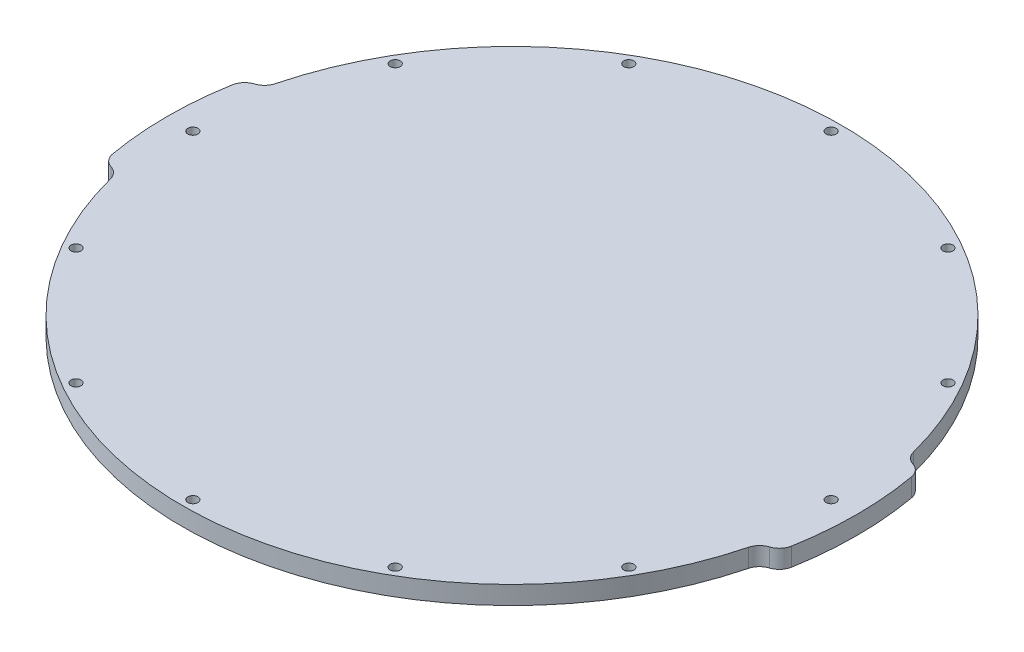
ISO-10303-21;
HEADER;
FILE_DESCRIPTION(('STEP AP214'),'2;1');
FILE_NAME('part.step','',(''),(''),'','','');
FILE_SCHEMA(('AUTOMOTIVE_DESIGN { 1 0 10303 214 1 1 1 1 }'));
ENDSEC;
DATA;
#1=APPLICATION_CONTEXT('core data for automotive mechanical design processes');
#2=APPLICATION_PROTOCOL_DEFINITION('international standard','automotive_design',2000,#1);
#3=PRODUCT_CONTEXT('',#1,'mechanical');
#4=PRODUCT('Part','Part','',(#3));
#5=PRODUCT_RELATED_PRODUCT_CATEGORY('part','',(#4));
#6=PRODUCT_DEFINITION_FORMATION('','',#4);
#7=PRODUCT_DEFINITION_CONTEXT('part definition',#1,'design');
#8=PRODUCT_DEFINITION('design','',#6,#7);
#9=PRODUCT_DEFINITION_SHAPE('','',#8);
#10=(LENGTH_UNIT() NAMED_UNIT(*) SI_UNIT(.MILLI.,.METRE.));
#11=(NAMED_UNIT(*) PLANE_ANGLE_UNIT() SI_UNIT($,.RADIAN.));
#12=(NAMED_UNIT(*) SI_UNIT($,.STERADIAN.) SOLID_ANGLE_UNIT());
#13=UNCERTAINTY_MEASURE_WITH_UNIT(LENGTH_MEASURE(1.E-05),#10,'distance_accuracy_value','');
#14=(GEOMETRIC_REPRESENTATION_CONTEXT(3) GLOBAL_UNCERTAINTY_ASSIGNED_CONTEXT((#13)) GLOBAL_UNIT_ASSIGNED_CONTEXT((#10,
#11,#12)) REPRESENTATION_CONTEXT('',''));
#15=CARTESIAN_POINT('',(0.,0.,0.));
#16=DIRECTION('',(0.,0.,1.));
#17=DIRECTION('',(1.,0.,0.));
#18=AXIS2_PLACEMENT_3D('',#15,#16,#17);
#19=CARTESIAN_POINT('',(-53.1549984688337,6.,-9.37266038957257));
#20=DIRECTION('',(0.,-1.,0.));
#21=DIRECTION('',(0.,0.,-1.));
#22=AXIS2_PLACEMENT_3D('',#19,#20,#21);
#23=PLANE('',#22);
#24=CARTESIAN_POINT('',(-90.5429559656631,6.,-52.2749999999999));
#25=DIRECTION('',(0.,1.,0.));
#26=DIRECTION('',(0.,0.,1.));
#27=AXIS2_PLACEMENT_3D('',#24,#25,#26);
#28=CIRCLE('',#27,1.65000000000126);
#29=CARTESIAN_POINT('',(-90.5429559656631,6.,-50.6249999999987));
#30=VERTEX_POINT('',#29);
#31=EDGE_CURVE('E356',#30,#30,#28,.T.);
#32=ORIENTED_EDGE('',*,*,#31,.F.);
#33=EDGE_LOOP('',(#32));
#34=FACE_BOUND('',#33,.T.);
#35=CARTESIAN_POINT('',(-90.542955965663,6.,52.2750000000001));
#36=DIRECTION('',(0.,1.,0.));
#37=DIRECTION('',(0.,0.,1.));
#38=AXIS2_PLACEMENT_3D('',#35,#36,#37);
#39=CIRCLE('',#38,1.65000000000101);
#40=CARTESIAN_POINT('',(-90.542955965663,6.,53.9250000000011));
#41=VERTEX_POINT('',#40);
#42=EDGE_CURVE('E344',#41,#41,#39,.T.);
#43=ORIENTED_EDGE('',*,*,#42,.F.);
#44=EDGE_LOOP('',(#43));
#45=FACE_BOUND('',#44,.T.);
#46=CARTESIAN_POINT('',(0.,6.,104.55));
#47=DIRECTION('',(0.,1.,0.));
#48=DIRECTION('',(0.,0.,1.));
#49=AXIS2_PLACEMENT_3D('',#46,#47,#48);
#50=CIRCLE('',#49,1.65000000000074);
#51=CARTESIAN_POINT('',(0.,6.,106.200000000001));
#52=VERTEX_POINT('',#51);
#53=EDGE_CURVE('E332',#52,#52,#50,.T.);
#54=ORIENTED_EDGE('',*,*,#53,.F.);
#55=EDGE_LOOP('',(#54));
#56=FACE_BOUND('',#55,.T.);
#57=CARTESIAN_POINT('',(90.5429559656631,6.,52.275));
#58=DIRECTION('',(0.,1.,0.));
#59=DIRECTION('',(0.,0.,1.));
#60=AXIS2_PLACEMENT_3D('',#57,#58,#59);
#61=CIRCLE('',#60,1.65000000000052);
#62=CARTESIAN_POINT('',(90.5429559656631,6.,53.9250000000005));
#63=VERTEX_POINT('',#62);
#64=EDGE_CURVE('E320',#63,#63,#61,.T.);
#65=ORIENTED_EDGE('',*,*,#64,.F.);
#66=EDGE_LOOP('',(#65));
#67=FACE_BOUND('',#66,.T.);
#68=CARTESIAN_POINT('',(90.5429559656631,6.,-52.275));
#69=DIRECTION('',(0.,1.,0.));
#70=DIRECTION('',(0.,0.,1.));
#71=AXIS2_PLACEMENT_3D('',#68,#69,#70);
#72=CIRCLE('',#71,1.65000000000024);
#73=CARTESIAN_POINT('',(90.5429559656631,6.,-50.6249999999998));
#74=VERTEX_POINT('',#73);
#75=EDGE_CURVE('E308',#74,#74,#72,.T.);
#76=ORIENTED_EDGE('',*,*,#75,.F.);
#77=EDGE_LOOP('',(#76));
#78=FACE_BOUND('',#77,.T.);
#79=CARTESIAN_POINT('',(0.,6.,-104.55));
#80=DIRECTION('',(0.,1.,0.));
#81=DIRECTION('',(0.,0.,1.));
#82=AXIS2_PLACEMENT_3D('',#79,#80,#81);
#83=CIRCLE('',#82,1.65);
#84=CARTESIAN_POINT('',(0.,6.,-102.9));
#85=VERTEX_POINT('',#84);
#86=EDGE_CURVE('E276',#85,#85,#83,.T.);
#87=ORIENTED_EDGE('',*,*,#86,.F.);
#88=EDGE_LOOP('',(#87));
#89=FACE_BOUND('',#88,.T.);
#90=CARTESIAN_POINT('',(0.,6.,0.));
#91=DIRECTION('',(0.,1.,0.));
#92=DIRECTION('',(0.,0.,-1.));
#93=AXIS2_PLACEMENT_3D('',#90,#91,#92);
#94=CIRCLE('',#93,107.95);
#95=CARTESIAN_POINT('',(104.513991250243,6.,-27.0190327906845));
#96=VERTEX_POINT('',#95);
#97=CARTESIAN_POINT('',(-104.513991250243,6.,-27.0190327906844));
#98=VERTEX_POINT('',#97);
#99=EDGE_CURVE('E271',#96,#98,#94,.T.);
#100=ORIENTED_EDGE('',*,*,#99,.T.);
#101=CARTESIAN_POINT('',(-109.354843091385,6.,-28.2704933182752));
#102=DIRECTION('',(0.,-1.,0.));
#103=DIRECTION('',(0.,0.,-1.));
#104=AXIS2_PLACEMENT_3D('',#101,#102,#103);
#105=CIRCLE('',#104,5.);
#106=CARTESIAN_POINT('',(-107.832420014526,6.,-23.5079070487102));
#107=VERTEX_POINT('',#106);
#108=EDGE_CURVE('E127',#98,#107,#105,.T.);
#109=ORIENTED_EDGE('',*,*,#108,.T.);
#110=CARTESIAN_POINT('',(-106.309996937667,6.,-18.7453207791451));
#111=DIRECTION('',(0.,1.,0.));
#112=DIRECTION('',(0.,0.,-1.));
#113=AXIS2_PLACEMENT_3D('',#110,#111,#112);
#114=CIRCLE('',#113,5.00000000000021);
#115=CARTESIAN_POINT('',(-111.234035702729,6.,-19.6135616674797));
#116=VERTEX_POINT('',#115);
#117=EDGE_CURVE('E120',#107,#116,#114,.T.);
#118=ORIENTED_EDGE('',*,*,#117,.T.);
#119=CARTESIAN_POINT('',(0.,6.,0.));
#120=DIRECTION('',(0.,1.,0.));
#121=DIRECTION('',(0.,0.,-1.));
#122=AXIS2_PLACEMENT_3D('',#119,#120,#121);
#123=CIRCLE('',#122,112.95);
#124=CARTESIAN_POINT('',(-111.234035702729,6.,19.6135616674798));
#125=VERTEX_POINT('',#124);
#126=EDGE_CURVE('E124',#116,#125,#123,.T.);
#127=ORIENTED_EDGE('',*,*,#126,.T.);
#128=CARTESIAN_POINT('',(-106.309996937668,6.,18.7453207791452));
#129=DIRECTION('',(0.,1.,0.));
#130=DIRECTION('',(0.,0.,1.));
#131=AXIS2_PLACEMENT_3D('',#128,#129,#130);
#132=CIRCLE('',#131,5.00000000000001);
#133=CARTESIAN_POINT('',(-107.832420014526,6.,23.5079070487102));
#134=VERTEX_POINT('',#133);
#135=EDGE_CURVE('E140',#125,#134,#132,.T.);
#136=ORIENTED_EDGE('',*,*,#135,.T.);
#137=CARTESIAN_POINT('',(-109.354843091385,6.,28.2704933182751));
#138=DIRECTION('',(0.,-1.,0.));
#139=DIRECTION('',(0.,0.,-1.));
#140=AXIS2_PLACEMENT_3D('',#137,#138,#139);
#141=CIRCLE('',#140,5.);
#142=CARTESIAN_POINT('',(-104.513991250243,6.,27.0190327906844));
#143=VERTEX_POINT('',#142);
#144=EDGE_CURVE('E11',#134,#143,#141,.T.);
#145=ORIENTED_EDGE('',*,*,#144,.T.);
#146=CARTESIAN_POINT('',(0.,6.,-4.92661467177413E-13));
#147=DIRECTION('',(0.,1.,0.));
#148=DIRECTION('',(0.,0.,-1.));
#149=AXIS2_PLACEMENT_3D('',#146,#147,#148);
#150=CIRCLE('',#149,107.95);
#151=CARTESIAN_POINT('',(104.513991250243,6.,27.0190327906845));
#152=VERTEX_POINT('',#151);
#153=EDGE_CURVE('E258',#143,#152,#150,.T.);
#154=ORIENTED_EDGE('',*,*,#153,.T.);
#155=CARTESIAN_POINT('',(109.354843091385,6.,28.2704933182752));
#156=DIRECTION('',(0.,-1.,0.));
#157=DIRECTION('',(0.,0.,-1.));
#158=AXIS2_PLACEMENT_3D('',#155,#156,#157);
#159=CIRCLE('',#158,5.);
#160=CARTESIAN_POINT('',(107.832420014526,6.,23.5079070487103));
#161=VERTEX_POINT('',#160);
#162=EDGE_CURVE('E171',#152,#161,#159,.T.);
#163=ORIENTED_EDGE('',*,*,#162,.T.);
#164=CARTESIAN_POINT('',(106.309996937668,6.,18.7453207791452));
#165=DIRECTION('',(0.,1.,0.));
#166=DIRECTION('',(0.,0.,-1.));
#167=AXIS2_PLACEMENT_3D('',#164,#165,#166);
#168=CIRCLE('',#167,5.00000000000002);
#169=CARTESIAN_POINT('',(111.234035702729,6.,19.6135616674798));
#170=VERTEX_POINT('',#169);
#171=EDGE_CURVE('E255',#161,#170,#168,.T.);
#172=ORIENTED_EDGE('',*,*,#171,.T.);
#173=CARTESIAN_POINT('',(-1.29063426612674E-12,6.,0.));
#174=DIRECTION('',(0.,1.,0.));
#175=DIRECTION('',(0.,0.,1.));
#176=AXIS2_PLACEMENT_3D('',#173,#174,#175);
#177=CIRCLE('',#176,112.950000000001);
#178=CARTESIAN_POINT('',(111.234035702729,6.,-19.6135616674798));
#179=VERTEX_POINT('',#178);
#180=EDGE_CURVE('E262',#170,#179,#177,.T.);
#181=ORIENTED_EDGE('',*,*,#180,.T.);
#182=CARTESIAN_POINT('',(106.309996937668,6.,-18.7453207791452));
#183=DIRECTION('',(0.,1.,0.));
#184=DIRECTION('',(0.,0.,1.));
#185=AXIS2_PLACEMENT_3D('',#182,#183,#184);
#186=CIRCLE('',#185,5.);
#187=CARTESIAN_POINT('',(107.832420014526,6.,-23.5079070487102));
#188=VERTEX_POINT('',#187);
#189=EDGE_CURVE('E264',#179,#188,#186,.T.);
#190=ORIENTED_EDGE('',*,*,#189,.T.);
#191=CARTESIAN_POINT('',(109.354843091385,6.,-28.2704933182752));
#192=DIRECTION('',(0.,-1.,0.));
#193=DIRECTION('',(0.,0.,-1.));
#194=AXIS2_PLACEMENT_3D('',#191,#192,#193);
#195=CIRCLE('',#194,5.);
#196=EDGE_CURVE('E175',#188,#96,#195,.T.);
#197=ORIENTED_EDGE('',*,*,#196,.T.);
#198=EDGE_LOOP('',(#100,#109,#118,#127,#136,#145,#154,#163,#172,#181,#190,#197));
#199=FACE_BOUND('',#198,.T.);
#200=CARTESIAN_POINT('',(52.275,6.,-90.5429559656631));
#201=DIRECTION('',(0.,1.,0.));
#202=DIRECTION('',(0.,0.,1.));
#203=AXIS2_PLACEMENT_3D('',#200,#201,#202);
#204=CIRCLE('',#203,1.65000000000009);
#205=CARTESIAN_POINT('',(52.275,6.,-88.892955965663));
#206=VERTEX_POINT('',#205);
#207=EDGE_CURVE('E302',#206,#206,#204,.T.);
#208=ORIENTED_EDGE('',*,*,#207,.F.);
#209=EDGE_LOOP('',(#208));
#210=FACE_BOUND('',#209,.T.);
#211=CARTESIAN_POINT('',(104.55,6.,0.));
#212=DIRECTION('',(0.,1.,0.));
#213=DIRECTION('',(0.,0.,1.));
#214=AXIS2_PLACEMENT_3D('',#211,#212,#213);
#215=CIRCLE('',#214,1.65000000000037);
#216=CARTESIAN_POINT('',(104.55,6.,1.65000000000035));
#217=VERTEX_POINT('',#216);
#218=EDGE_CURVE('E314',#217,#217,#215,.T.);
#219=ORIENTED_EDGE('',*,*,#218,.F.);
#220=EDGE_LOOP('',(#219));
#221=FACE_BOUND('',#220,.T.);
#222=CARTESIAN_POINT('',(52.2750000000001,6.,90.542955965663));
#223=DIRECTION('',(0.,1.,0.));
#224=DIRECTION('',(0.,0.,1.));
#225=AXIS2_PLACEMENT_3D('',#222,#223,#224);
#226=CIRCLE('',#225,1.65000000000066);
#227=CARTESIAN_POINT('',(52.2750000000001,6.,92.1929559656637));
#228=VERTEX_POINT('',#227);
#229=EDGE_CURVE('E326',#228,#228,#226,.T.);
#230=ORIENTED_EDGE('',*,*,#229,.F.);
#231=EDGE_LOOP('',(#230));
#232=FACE_BOUND('',#231,.T.);
#233=CARTESIAN_POINT('',(-52.2749999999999,6.,90.5429559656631));
#234=DIRECTION('',(0.,1.,0.));
#235=DIRECTION('',(0.,0.,1.));
#236=AXIS2_PLACEMENT_3D('',#233,#234,#235);
#237=CIRCLE('',#236,1.65000000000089);
#238=CARTESIAN_POINT('',(-52.2749999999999,6.,92.192955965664));
#239=VERTEX_POINT('',#238);
#240=EDGE_CURVE('E338',#239,#239,#237,.T.);
#241=ORIENTED_EDGE('',*,*,#240,.F.);
#242=EDGE_LOOP('',(#241));
#243=FACE_BOUND('',#242,.T.);
#244=CARTESIAN_POINT('',(-104.55,6.,0.));
#245=DIRECTION('',(0.,1.,0.));
#246=DIRECTION('',(0.,0.,1.));
#247=AXIS2_PLACEMENT_3D('',#244,#245,#246);
#248=CIRCLE('',#247,1.65000000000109);
#249=CARTESIAN_POINT('',(-104.55,6.,1.65000000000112));
#250=VERTEX_POINT('',#249);
#251=EDGE_CURVE('E350',#250,#250,#248,.T.);
#252=ORIENTED_EDGE('',*,*,#251,.F.);
#253=EDGE_LOOP('',(#252));
#254=FACE_BOUND('',#253,.T.);
#255=CARTESIAN_POINT('',(-52.275,6.,-90.542955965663));
#256=DIRECTION('',(0.,1.,0.));
#257=DIRECTION('',(0.,0.,1.));
#258=AXIS2_PLACEMENT_3D('',#255,#256,#257);
#259=CIRCLE('',#258,1.65000000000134);
#260=CARTESIAN_POINT('',(-52.275,6.,-88.8929559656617));
#261=VERTEX_POINT('',#260);
#262=EDGE_CURVE('E362',#261,#261,#259,.T.);
#263=ORIENTED_EDGE('',*,*,#262,.F.);
#264=EDGE_LOOP('',(#263));
#265=FACE_BOUND('',#264,.T.);
#266=ADVANCED_FACE('F32',(#34,#45,#56,#67,#78,#89,#199,#210,#221,#232,#243,#254,#265),#23,.F.);
#267=CARTESIAN_POINT('',(-53.1549984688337,0.,-9.37266038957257));
#268=DIRECTION('',(0.,-1.,0.));
#269=DIRECTION('',(0.,0.,-1.));
#270=AXIS2_PLACEMENT_3D('',#267,#268,#269);
#271=PLANE('',#270);
#272=CARTESIAN_POINT('',(-90.5429559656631,0.,-52.2749999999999));
#273=DIRECTION('',(0.,1.,0.));
#274=DIRECTION('',(0.,0.,1.));
#275=AXIS2_PLACEMENT_3D('',#272,#273,#274);
#276=CIRCLE('',#275,1.65000000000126);
#277=CARTESIAN_POINT('',(-90.5429559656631,0.,-50.6249999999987));
#278=VERTEX_POINT('',#277);
#279=EDGE_CURVE('E359',#278,#278,#276,.T.);
#280=ORIENTED_EDGE('',*,*,#279,.T.);
#281=EDGE_LOOP('',(#280));
#282=FACE_BOUND('',#281,.T.);
#283=CARTESIAN_POINT('',(-90.542955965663,0.,52.2750000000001));
#284=DIRECTION('',(0.,1.,0.));
#285=DIRECTION('',(0.,0.,1.));
#286=AXIS2_PLACEMENT_3D('',#283,#284,#285);
#287=CIRCLE('',#286,1.65000000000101);
#288=CARTESIAN_POINT('',(-90.542955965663,0.,53.9250000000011));
#289=VERTEX_POINT('',#288);
#290=EDGE_CURVE('E347',#289,#289,#287,.T.);
#291=ORIENTED_EDGE('',*,*,#290,.T.);
#292=EDGE_LOOP('',(#291));
#293=FACE_BOUND('',#292,.T.);
#294=CARTESIAN_POINT('',(0.,0.,104.55));
#295=DIRECTION('',(0.,1.,0.));
#296=DIRECTION('',(0.,0.,1.));
#297=AXIS2_PLACEMENT_3D('',#294,#295,#296);
#298=CIRCLE('',#297,1.65000000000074);
#299=CARTESIAN_POINT('',(0.,0.,106.200000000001));
#300=VERTEX_POINT('',#299);
#301=EDGE_CURVE('E335',#300,#300,#298,.T.);
#302=ORIENTED_EDGE('',*,*,#301,.T.);
#303=EDGE_LOOP('',(#302));
#304=FACE_BOUND('',#303,.T.);
#305=CARTESIAN_POINT('',(90.5429559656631,0.,52.275));
#306=DIRECTION('',(0.,1.,0.));
#307=DIRECTION('',(0.,0.,1.));
#308=AXIS2_PLACEMENT_3D('',#305,#306,#307);
#309=CIRCLE('',#308,1.65000000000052);
#310=CARTESIAN_POINT('',(90.5429559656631,0.,53.9250000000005));
#311=VERTEX_POINT('',#310);
#312=EDGE_CURVE('E323',#311,#311,#309,.T.);
#313=ORIENTED_EDGE('',*,*,#312,.T.);
#314=EDGE_LOOP('',(#313));
#315=FACE_BOUND('',#314,.T.);
#316=CARTESIAN_POINT('',(90.5429559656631,0.,-52.275));
#317=DIRECTION('',(0.,1.,0.));
#318=DIRECTION('',(0.,0.,1.));
#319=AXIS2_PLACEMENT_3D('',#316,#317,#318);
#320=CIRCLE('',#319,1.65000000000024);
#321=CARTESIAN_POINT('',(90.5429559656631,0.,-50.6249999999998));
#322=VERTEX_POINT('',#321);
#323=EDGE_CURVE('E311',#322,#322,#320,.T.);
#324=ORIENTED_EDGE('',*,*,#323,.T.);
#325=EDGE_LOOP('',(#324));
#326=FACE_BOUND('',#325,.T.);
#327=CARTESIAN_POINT('',(0.,0.,-104.55));
#328=DIRECTION('',(0.,1.,0.));
#329=DIRECTION('',(0.,0.,1.));
#330=AXIS2_PLACEMENT_3D('',#327,#328,#329);
#331=CIRCLE('',#330,1.65);
#332=CARTESIAN_POINT('',(0.,0.,-102.9));
#333=VERTEX_POINT('',#332);
#334=EDGE_CURVE('E299',#333,#333,#331,.T.);
#335=ORIENTED_EDGE('',*,*,#334,.T.);
#336=EDGE_LOOP('',(#335));
#337=FACE_BOUND('',#336,.T.);
#338=CARTESIAN_POINT('',(-106.309996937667,0.,-18.7453207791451));
#339=DIRECTION('',(0.,1.,0.));
#340=DIRECTION('',(0.,0.,-1.));
#341=AXIS2_PLACEMENT_3D('',#338,#339,#340);
#342=CIRCLE('',#341,5.00000000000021);
#343=CARTESIAN_POINT('',(-107.832420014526,0.,-23.5079070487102));
#344=VERTEX_POINT('',#343);
#345=CARTESIAN_POINT('',(-111.234035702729,0.,-19.6135616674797));
#346=VERTEX_POINT('',#345);
#347=EDGE_CURVE('E144',#344,#346,#342,.T.);
#348=ORIENTED_EDGE('',*,*,#347,.F.);
#349=CARTESIAN_POINT('',(-109.354843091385,0.,-28.2704933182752));
#350=DIRECTION('',(0.,-1.,0.));
#351=DIRECTION('',(0.,0.,-1.));
#352=AXIS2_PLACEMENT_3D('',#349,#350,#351);
#353=CIRCLE('',#352,5.);
#354=CARTESIAN_POINT('',(-104.513991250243,0.,-27.0190327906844));
#355=VERTEX_POINT('',#354);
#356=EDGE_CURVE('E177',#344,#355,#353,.F.);
#357=ORIENTED_EDGE('',*,*,#356,.T.);
#358=CARTESIAN_POINT('',(0.,0.,0.));
#359=DIRECTION('',(0.,1.,0.));
#360=DIRECTION('',(0.,0.,-1.));
#361=AXIS2_PLACEMENT_3D('',#358,#359,#360);
#362=CIRCLE('',#361,107.95);
#363=CARTESIAN_POINT('',(104.513991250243,0.,-27.0190327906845));
#364=VERTEX_POINT('',#363);
#365=EDGE_CURVE('E132',#364,#355,#362,.T.);
#366=ORIENTED_EDGE('',*,*,#365,.F.);
#367=CARTESIAN_POINT('',(109.354843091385,0.,-28.2704933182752));
#368=DIRECTION('',(0.,-1.,0.));
#369=DIRECTION('',(0.,0.,-1.));
#370=AXIS2_PLACEMENT_3D('',#367,#368,#369);
#371=CIRCLE('',#370,5.);
#372=CARTESIAN_POINT('',(107.832420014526,0.,-23.5079070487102));
#373=VERTEX_POINT('',#372);
#374=EDGE_CURVE('E173',#364,#373,#371,.F.);
#375=ORIENTED_EDGE('',*,*,#374,.T.);
#376=CARTESIAN_POINT('',(106.309996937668,0.,-18.7453207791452));
#377=DIRECTION('',(0.,1.,0.));
#378=DIRECTION('',(0.,0.,1.));
#379=AXIS2_PLACEMENT_3D('',#376,#377,#378);
#380=CIRCLE('',#379,5.);
#381=CARTESIAN_POINT('',(111.234035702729,0.,-19.6135616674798));
#382=VERTEX_POINT('',#381);
#383=EDGE_CURVE('E189',#382,#373,#380,.T.);
#384=ORIENTED_EDGE('',*,*,#383,.F.);
#385=CARTESIAN_POINT('',(-1.29063426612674E-12,0.,0.));
#386=DIRECTION('',(0.,1.,0.));
#387=DIRECTION('',(0.,0.,1.));
#388=AXIS2_PLACEMENT_3D('',#385,#386,#387);
#389=CIRCLE('',#388,112.950000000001);
#390=CARTESIAN_POINT('',(111.234035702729,0.,19.6135616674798));
#391=VERTEX_POINT('',#390);
#392=EDGE_CURVE('E285',#391,#382,#389,.T.);
#393=ORIENTED_EDGE('',*,*,#392,.F.);
#394=CARTESIAN_POINT('',(106.309996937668,0.,18.7453207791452));
#395=DIRECTION('',(0.,1.,0.));
#396=DIRECTION('',(0.,0.,-1.));
#397=AXIS2_PLACEMENT_3D('',#394,#395,#396);
#398=CIRCLE('',#397,5.00000000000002);
#399=CARTESIAN_POINT('',(107.832420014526,0.,23.5079070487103));
#400=VERTEX_POINT('',#399);
#401=EDGE_CURVE('E283',#400,#391,#398,.T.);
#402=ORIENTED_EDGE('',*,*,#401,.F.);
#403=CARTESIAN_POINT('',(109.354843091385,0.,28.2704933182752));
#404=DIRECTION('',(0.,-1.,0.));
#405=DIRECTION('',(0.,0.,-1.));
#406=AXIS2_PLACEMENT_3D('',#403,#404,#405);
#407=CIRCLE('',#406,5.);
#408=CARTESIAN_POINT('',(104.513991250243,0.,27.0190327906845));
#409=VERTEX_POINT('',#408);
#410=EDGE_CURVE('E169',#400,#409,#407,.F.);
#411=ORIENTED_EDGE('',*,*,#410,.T.);
#412=CARTESIAN_POINT('',(0.,0.,-4.92661467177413E-13));
#413=DIRECTION('',(0.,1.,0.));
#414=DIRECTION('',(0.,0.,-1.));
#415=AXIS2_PLACEMENT_3D('',#412,#413,#414);
#416=CIRCLE('',#415,107.95);
#417=CARTESIAN_POINT('',(-104.513991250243,0.,27.0190327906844));
#418=VERTEX_POINT('',#417);
#419=EDGE_CURVE('E280',#418,#409,#416,.T.);
#420=ORIENTED_EDGE('',*,*,#419,.F.);
#421=CARTESIAN_POINT('',(-109.354843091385,0.,28.2704933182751));
#422=DIRECTION('',(0.,-1.,0.));
#423=DIRECTION('',(0.,0.,-1.));
#424=AXIS2_PLACEMENT_3D('',#421,#422,#423);
#425=CIRCLE('',#424,5.);
#426=CARTESIAN_POINT('',(-107.832420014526,0.,23.5079070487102));
#427=VERTEX_POINT('',#426);
#428=EDGE_CURVE('E40',#418,#427,#425,.F.);
#429=ORIENTED_EDGE('',*,*,#428,.T.);
#430=CARTESIAN_POINT('',(-106.309996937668,0.,18.7453207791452));
#431=DIRECTION('',(0.,1.,0.));
#432=DIRECTION('',(0.,0.,1.));
#433=AXIS2_PLACEMENT_3D('',#430,#431,#432);
#434=CIRCLE('',#433,5.00000000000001);
#435=CARTESIAN_POINT('',(-111.234035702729,0.,19.6135616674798));
#436=VERTEX_POINT('',#435);
#437=EDGE_CURVE('E278',#436,#427,#434,.T.);
#438=ORIENTED_EDGE('',*,*,#437,.F.);
#439=CARTESIAN_POINT('',(0.,0.,0.));
#440=DIRECTION('',(0.,1.,0.));
#441=DIRECTION('',(0.,0.,-1.));
#442=AXIS2_PLACEMENT_3D('',#439,#440,#441);
#443=CIRCLE('',#442,112.95);
#444=EDGE_CURVE('E275',#346,#436,#443,.T.);
#445=ORIENTED_EDGE('',*,*,#444,.F.);
#446=EDGE_LOOP('',(#348,#357,#366,#375,#384,#393,#402,#411,#420,#429,#438,#445));
#447=FACE_BOUND('',#446,.T.);
#448=CARTESIAN_POINT('',(52.275,0.,-90.5429559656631));
#449=DIRECTION('',(0.,1.,0.));
#450=DIRECTION('',(0.,0.,1.));
#451=AXIS2_PLACEMENT_3D('',#448,#449,#450);
#452=CIRCLE('',#451,1.65000000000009);
#453=CARTESIAN_POINT('',(52.275,0.,-88.892955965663));
#454=VERTEX_POINT('',#453);
#455=EDGE_CURVE('E305',#454,#454,#452,.T.);
#456=ORIENTED_EDGE('',*,*,#455,.T.);
#457=EDGE_LOOP('',(#456));
#458=FACE_BOUND('',#457,.T.);
#459=CARTESIAN_POINT('',(104.55,0.,0.));
#460=DIRECTION('',(0.,1.,0.));
#461=DIRECTION('',(0.,0.,1.));
#462=AXIS2_PLACEMENT_3D('',#459,#460,#461);
#463=CIRCLE('',#462,1.65000000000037);
#464=CARTESIAN_POINT('',(104.55,0.,1.65000000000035));
#465=VERTEX_POINT('',#464);
#466=EDGE_CURVE('E317',#465,#465,#463,.T.);
#467=ORIENTED_EDGE('',*,*,#466,.T.);
#468=EDGE_LOOP('',(#467));
#469=FACE_BOUND('',#468,.T.);
#470=CARTESIAN_POINT('',(52.2750000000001,0.,90.542955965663));
#471=DIRECTION('',(0.,1.,0.));
#472=DIRECTION('',(0.,0.,1.));
#473=AXIS2_PLACEMENT_3D('',#470,#471,#472);
#474=CIRCLE('',#473,1.65000000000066);
#475=CARTESIAN_POINT('',(52.2750000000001,0.,92.1929559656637));
#476=VERTEX_POINT('',#475);
#477=EDGE_CURVE('E329',#476,#476,#474,.T.);
#478=ORIENTED_EDGE('',*,*,#477,.T.);
#479=EDGE_LOOP('',(#478));
#480=FACE_BOUND('',#479,.T.);
#481=CARTESIAN_POINT('',(-52.2749999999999,0.,90.5429559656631));
#482=DIRECTION('',(0.,1.,0.));
#483=DIRECTION('',(0.,0.,1.));
#484=AXIS2_PLACEMENT_3D('',#481,#482,#483);
#485=CIRCLE('',#484,1.65000000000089);
#486=CARTESIAN_POINT('',(-52.2749999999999,0.,92.192955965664));
#487=VERTEX_POINT('',#486);
#488=EDGE_CURVE('E341',#487,#487,#485,.T.);
#489=ORIENTED_EDGE('',*,*,#488,.T.);
#490=EDGE_LOOP('',(#489));
#491=FACE_BOUND('',#490,.T.);
#492=CARTESIAN_POINT('',(-104.55,0.,0.));
#493=DIRECTION('',(0.,1.,0.));
#494=DIRECTION('',(0.,0.,1.));
#495=AXIS2_PLACEMENT_3D('',#492,#493,#494);
#496=CIRCLE('',#495,1.65000000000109);
#497=CARTESIAN_POINT('',(-104.55,0.,1.65000000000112));
#498=VERTEX_POINT('',#497);
#499=EDGE_CURVE('E353',#498,#498,#496,.T.);
#500=ORIENTED_EDGE('',*,*,#499,.T.);
#501=EDGE_LOOP('',(#500));
#502=FACE_BOUND('',#501,.T.);
#503=CARTESIAN_POINT('',(-52.275,0.,-90.542955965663));
#504=DIRECTION('',(0.,1.,0.));
#505=DIRECTION('',(0.,0.,1.));
#506=AXIS2_PLACEMENT_3D('',#503,#504,#505);
#507=CIRCLE('',#506,1.65000000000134);
#508=CARTESIAN_POINT('',(-52.275,0.,-88.8929559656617));
#509=VERTEX_POINT('',#508);
#510=EDGE_CURVE('E365',#509,#509,#507,.T.);
#511=ORIENTED_EDGE('',*,*,#510,.T.);
#512=EDGE_LOOP('',(#511));
#513=FACE_BOUND('',#512,.T.);
#514=ADVANCED_FACE('F181',(#282,#293,#304,#315,#326,#337,#447,#458,#469,#480,#491,#502,#513),
#271,.T.);
#515=CARTESIAN_POINT('',(-106.309996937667,6.,-18.7453207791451));
#516=DIRECTION('',(0.,-1.,0.));
#517=DIRECTION('',(0.,0.,-1.));
#518=AXIS2_PLACEMENT_3D('',#515,#516,#517);
#519=CYLINDRICAL_SURFACE('',#518,5.00000000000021);
#520=ORIENTED_EDGE('',*,*,#117,.F.);
#521=DIRECTION('',(0.,-1.,0.));
#522=VECTOR('',#521,1.);
#523=CARTESIAN_POINT('',(-107.832420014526,6.,-23.5079070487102));
#524=LINE('',#523,#522);
#525=EDGE_CURVE('E166',#107,#344,#524,.T.);
#526=ORIENTED_EDGE('',*,*,#525,.T.);
#527=ORIENTED_EDGE('',*,*,#347,.T.);
#528=DIRECTION('',(0.,-1.,0.));
#529=VECTOR('',#528,1.);
#530=CARTESIAN_POINT('',(-111.234035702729,6.,-19.6135616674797));
#531=LINE('',#530,#529);
#532=EDGE_CURVE('E137',#116,#346,#531,.T.);
#533=ORIENTED_EDGE('',*,*,#532,.F.);
#534=EDGE_LOOP('',(#520,#526,#527,#533));
#535=FACE_BOUND('',#534,.T.);
#536=ADVANCED_FACE('F142',(#535),#519,.T.);
#537=CARTESIAN_POINT('',(0.,6.,0.));
#538=DIRECTION('',(0.,-1.,0.));
#539=DIRECTION('',(0.,0.,-1.));
#540=AXIS2_PLACEMENT_3D('',#537,#538,#539);
#541=CYLINDRICAL_SURFACE('',#540,112.95);
#542=ORIENTED_EDGE('',*,*,#444,.T.);
#543=DIRECTION('',(0.,-1.,0.));
#544=VECTOR('',#543,1.);
#545=CARTESIAN_POINT('',(-111.234035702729,6.,19.6135616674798));
#546=LINE('',#545,#544);
#547=EDGE_CURVE('E139',#125,#436,#546,.T.);
#548=ORIENTED_EDGE('',*,*,#547,.F.);
#549=ORIENTED_EDGE('',*,*,#126,.F.);
#550=ORIENTED_EDGE('',*,*,#532,.T.);
#551=EDGE_LOOP('',(#542,#548,#549,#550));
#552=FACE_BOUND('',#551,.T.);
#553=ADVANCED_FACE('F136',(#552),#541,.T.);
#554=CARTESIAN_POINT('',(-106.309996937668,6.,18.7453207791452));
#555=DIRECTION('',(0.,-1.,0.));
#556=DIRECTION('',(0.,0.,-1.));
#557=AXIS2_PLACEMENT_3D('',#554,#555,#556);
#558=CYLINDRICAL_SURFACE('',#557,5.00000000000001);
#559=ORIENTED_EDGE('',*,*,#437,.T.);
#560=DIRECTION('',(0.,-1.,0.));
#561=VECTOR('',#560,1.);
#562=CARTESIAN_POINT('',(-107.832420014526,6.,23.5079070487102));
#563=LINE('',#562,#561);
#564=EDGE_CURVE('E47',#427,#134,#563,.F.);
#565=ORIENTED_EDGE('',*,*,#564,.T.);
#566=ORIENTED_EDGE('',*,*,#135,.F.);
#567=ORIENTED_EDGE('',*,*,#547,.T.);
#568=EDGE_LOOP('',(#559,#565,#566,#567));
#569=FACE_BOUND('',#568,.T.);
#570=ADVANCED_FACE('F233',(#569),#558,.T.);
#571=CARTESIAN_POINT('',(0.,6.,-4.92661467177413E-13));
#572=DIRECTION('',(0.,-1.,0.));
#573=DIRECTION('',(0.,0.,-1.));
#574=AXIS2_PLACEMENT_3D('',#571,#572,#573);
#575=CYLINDRICAL_SURFACE('',#574,107.95);
#576=ORIENTED_EDGE('',*,*,#419,.T.);
#577=DIRECTION('',(0.,-1.,0.));
#578=VECTOR('',#577,1.);
#579=CARTESIAN_POINT('',(104.513991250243,6.,27.0190327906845));
#580=LINE('',#579,#578);
#581=EDGE_CURVE('E157',#409,#152,#580,.F.);
#582=ORIENTED_EDGE('',*,*,#581,.T.);
#583=ORIENTED_EDGE('',*,*,#153,.F.);
#584=DIRECTION('',(0.,-1.,0.));
#585=VECTOR('',#584,1.);
#586=CARTESIAN_POINT('',(-104.513991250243,6.,27.0190327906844));
#587=LINE('',#586,#585);
#588=EDGE_CURVE('E149',#143,#418,#587,.T.);
#589=ORIENTED_EDGE('',*,*,#588,.T.);
#590=EDGE_LOOP('',(#576,#582,#583,#589));
#591=FACE_BOUND('',#590,.T.);
#592=ADVANCED_FACE('F229',(#591),#575,.T.);
#593=CARTESIAN_POINT('',(106.309996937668,6.,18.7453207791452));
#594=DIRECTION('',(0.,-1.,0.));
#595=DIRECTION('',(0.,0.,-1.));
#596=AXIS2_PLACEMENT_3D('',#593,#594,#595);
#597=CYLINDRICAL_SURFACE('',#596,5.00000000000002);
#598=ORIENTED_EDGE('',*,*,#171,.F.);
#599=DIRECTION('',(0.,-1.,0.));
#600=VECTOR('',#599,1.);
#601=CARTESIAN_POINT('',(107.832420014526,6.,23.5079070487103));
#602=LINE('',#601,#600);
#603=EDGE_CURVE('E146',#161,#400,#602,.T.);
#604=ORIENTED_EDGE('',*,*,#603,.T.);
#605=ORIENTED_EDGE('',*,*,#401,.T.);
#606=DIRECTION('',(0.,-1.,0.));
#607=VECTOR('',#606,1.);
#608=CARTESIAN_POINT('',(111.234035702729,6.,19.6135616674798));
#609=LINE('',#608,#607);
#610=EDGE_CURVE('E151',#170,#391,#609,.T.);
#611=ORIENTED_EDGE('',*,*,#610,.F.);
#612=EDGE_LOOP('',(#598,#604,#605,#611));
#613=FACE_BOUND('',#612,.T.);
#614=ADVANCED_FACE('F225',(#613),#597,.T.);
#615=CARTESIAN_POINT('',(-1.29063426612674E-12,6.,0.));
#616=DIRECTION('',(0.,-1.,0.));
#617=DIRECTION('',(0.,0.,-1.));
#618=AXIS2_PLACEMENT_3D('',#615,#616,#617);
#619=CYLINDRICAL_SURFACE('',#618,112.950000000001);
#620=ORIENTED_EDGE('',*,*,#392,.T.);
#621=DIRECTION('',(0.,-1.,0.));
#622=VECTOR('',#621,1.);
#623=CARTESIAN_POINT('',(111.234035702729,6.,-19.6135616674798));
#624=LINE('',#623,#622);
#625=EDGE_CURVE('E273',#179,#382,#624,.T.);
#626=ORIENTED_EDGE('',*,*,#625,.F.);
#627=ORIENTED_EDGE('',*,*,#180,.F.);
#628=ORIENTED_EDGE('',*,*,#610,.T.);
#629=EDGE_LOOP('',(#620,#626,#627,#628));
#630=FACE_BOUND('',#629,.T.);
#631=ADVANCED_FACE('F221',(#630),#619,.T.);
#632=CARTESIAN_POINT('',(106.309996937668,6.,-18.7453207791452));
#633=DIRECTION('',(0.,-1.,0.));
#634=DIRECTION('',(0.,0.,-1.));
#635=AXIS2_PLACEMENT_3D('',#632,#633,#634);
#636=CYLINDRICAL_SURFACE('',#635,5.);
#637=ORIENTED_EDGE('',*,*,#383,.T.);
#638=DIRECTION('',(0.,-1.,0.));
#639=VECTOR('',#638,1.);
#640=CARTESIAN_POINT('',(107.832420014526,6.,-23.5079070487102));
#641=LINE('',#640,#639);
#642=EDGE_CURVE('E164',#373,#188,#641,.F.);
#643=ORIENTED_EDGE('',*,*,#642,.T.);
#644=ORIENTED_EDGE('',*,*,#189,.F.);
#645=ORIENTED_EDGE('',*,*,#625,.T.);
#646=EDGE_LOOP('',(#637,#643,#644,#645));
#647=FACE_BOUND('',#646,.T.);
#648=ADVANCED_FACE('F218',(#647),#636,.T.);
#649=CARTESIAN_POINT('',(0.,6.,0.));
#650=DIRECTION('',(0.,-1.,0.));
#651=DIRECTION('',(0.,0.,-1.));
#652=AXIS2_PLACEMENT_3D('',#649,#650,#651);
#653=CYLINDRICAL_SURFACE('',#652,107.95);
#654=ORIENTED_EDGE('',*,*,#99,.F.);
#655=DIRECTION('',(0.,-1.,0.));
#656=VECTOR('',#655,1.);
#657=CARTESIAN_POINT('',(104.513991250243,6.,-27.0190327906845));
#658=LINE('',#657,#656);
#659=EDGE_CURVE('E161',#96,#364,#658,.T.);
#660=ORIENTED_EDGE('',*,*,#659,.T.);
#661=ORIENTED_EDGE('',*,*,#365,.T.);
#662=DIRECTION('',(0.,-1.,0.));
#663=VECTOR('',#662,1.);
#664=CARTESIAN_POINT('',(-104.513991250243,6.,-27.0190327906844));
#665=LINE('',#664,#663);
#666=EDGE_CURVE('E159',#355,#98,#665,.F.);
#667=ORIENTED_EDGE('',*,*,#666,.T.);
#668=EDGE_LOOP('',(#654,#660,#661,#667));
#669=FACE_BOUND('',#668,.T.);
#670=ADVANCED_FACE('F187',(#669),#653,.T.);
#671=CARTESIAN_POINT('',(0.,6.,-104.55));
#672=DIRECTION('',(0.,-1.,0.));
#673=DIRECTION('',(0.,0.,-1.));
#674=AXIS2_PLACEMENT_3D('',#671,#672,#673);
#675=CYLINDRICAL_SURFACE('',#674,1.65);
#676=ORIENTED_EDGE('',*,*,#86,.T.);
#677=EDGE_LOOP('',(#676));
#678=FACE_BOUND('',#677,.T.);
#679=ORIENTED_EDGE('',*,*,#334,.F.);
#680=EDGE_LOOP('',(#679));
#681=FACE_BOUND('',#680,.T.);
#682=ADVANCED_FACE('F213',(#678,#681),#675,.F.);
#683=CARTESIAN_POINT('',(52.275,6.,-90.5429559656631));
#684=DIRECTION('',(0.,-1.,0.));
#685=DIRECTION('',(0.,0.,-1.));
#686=AXIS2_PLACEMENT_3D('',#683,#684,#685);
#687=CYLINDRICAL_SURFACE('',#686,1.65000000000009);
#688=ORIENTED_EDGE('',*,*,#207,.T.);
#689=EDGE_LOOP('',(#688));
#690=FACE_BOUND('',#689,.T.);
#691=ORIENTED_EDGE('',*,*,#455,.F.);
#692=EDGE_LOOP('',(#691));
#693=FACE_BOUND('',#692,.T.);
#694=ADVANCED_FACE('F392',(#690,#693),#687,.F.);
#695=CARTESIAN_POINT('',(90.5429559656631,6.,-52.275));
#696=DIRECTION('',(0.,-1.,0.));
#697=DIRECTION('',(0.,0.,-1.));
#698=AXIS2_PLACEMENT_3D('',#695,#696,#697);
#699=CYLINDRICAL_SURFACE('',#698,1.65000000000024);
#700=ORIENTED_EDGE('',*,*,#75,.T.);
#701=EDGE_LOOP('',(#700));
#702=FACE_BOUND('',#701,.T.);
#703=ORIENTED_EDGE('',*,*,#323,.F.);
#704=EDGE_LOOP('',(#703));
#705=FACE_BOUND('',#704,.T.);
#706=ADVANCED_FACE('F397',(#702,#705),#699,.F.);
#707=CARTESIAN_POINT('',(104.55,6.,0.));
#708=DIRECTION('',(0.,-1.,0.));
#709=DIRECTION('',(0.,0.,-1.));
#710=AXIS2_PLACEMENT_3D('',#707,#708,#709);
#711=CYLINDRICAL_SURFACE('',#710,1.65000000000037);
#712=ORIENTED_EDGE('',*,*,#218,.T.);
#713=EDGE_LOOP('',(#712));
#714=FACE_BOUND('',#713,.T.);
#715=ORIENTED_EDGE('',*,*,#466,.F.);
#716=EDGE_LOOP('',(#715));
#717=FACE_BOUND('',#716,.T.);
#718=ADVANCED_FACE('F404',(#714,#717),#711,.F.);
#719=CARTESIAN_POINT('',(90.5429559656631,6.,52.275));
#720=DIRECTION('',(0.,-1.,0.));
#721=DIRECTION('',(0.,0.,-1.));
#722=AXIS2_PLACEMENT_3D('',#719,#720,#721);
#723=CYLINDRICAL_SURFACE('',#722,1.65000000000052);
#724=ORIENTED_EDGE('',*,*,#64,.T.);
#725=EDGE_LOOP('',(#724));
#726=FACE_BOUND('',#725,.T.);
#727=ORIENTED_EDGE('',*,*,#312,.F.);
#728=EDGE_LOOP('',(#727));
#729=FACE_BOUND('',#728,.T.);
#730=ADVANCED_FACE('F411',(#726,#729),#723,.F.);
#731=CARTESIAN_POINT('',(52.2750000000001,6.,90.542955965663));
#732=DIRECTION('',(0.,-1.,0.));
#733=DIRECTION('',(0.,0.,-1.));
#734=AXIS2_PLACEMENT_3D('',#731,#732,#733);
#735=CYLINDRICAL_SURFACE('',#734,1.65000000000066);
#736=ORIENTED_EDGE('',*,*,#229,.T.);
#737=EDGE_LOOP('',(#736));
#738=FACE_BOUND('',#737,.T.);
#739=ORIENTED_EDGE('',*,*,#477,.F.);
#740=EDGE_LOOP('',(#739));
#741=FACE_BOUND('',#740,.T.);
#742=ADVANCED_FACE('F415',(#738,#741),#735,.F.);
#743=CARTESIAN_POINT('',(0.,6.,104.55));
#744=DIRECTION('',(0.,-1.,0.));
#745=DIRECTION('',(0.,0.,-1.));
#746=AXIS2_PLACEMENT_3D('',#743,#744,#745);
#747=CYLINDRICAL_SURFACE('',#746,1.65000000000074);
#748=ORIENTED_EDGE('',*,*,#53,.T.);
#749=EDGE_LOOP('',(#748));
#750=FACE_BOUND('',#749,.T.);
#751=ORIENTED_EDGE('',*,*,#301,.F.);
#752=EDGE_LOOP('',(#751));
#753=FACE_BOUND('',#752,.T.);
#754=ADVANCED_FACE('F419',(#750,#753),#747,.F.);
#755=CARTESIAN_POINT('',(-52.2749999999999,6.,90.5429559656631));
#756=DIRECTION('',(0.,-1.,0.));
#757=DIRECTION('',(0.,0.,-1.));
#758=AXIS2_PLACEMENT_3D('',#755,#756,#757);
#759=CYLINDRICAL_SURFACE('',#758,1.65000000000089);
#760=ORIENTED_EDGE('',*,*,#240,.T.);
#761=EDGE_LOOP('',(#760));
#762=FACE_BOUND('',#761,.T.);
#763=ORIENTED_EDGE('',*,*,#488,.F.);
#764=EDGE_LOOP('',(#763));
#765=FACE_BOUND('',#764,.T.);
#766=ADVANCED_FACE('F423',(#762,#765),#759,.F.);
#767=CARTESIAN_POINT('',(-90.542955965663,6.,52.2750000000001));
#768=DIRECTION('',(0.,-1.,0.));
#769=DIRECTION('',(0.,0.,-1.));
#770=AXIS2_PLACEMENT_3D('',#767,#768,#769);
#771=CYLINDRICAL_SURFACE('',#770,1.65000000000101);
#772=ORIENTED_EDGE('',*,*,#42,.T.);
#773=EDGE_LOOP('',(#772));
#774=FACE_BOUND('',#773,.T.);
#775=ORIENTED_EDGE('',*,*,#290,.F.);
#776=EDGE_LOOP('',(#775));
#777=FACE_BOUND('',#776,.T.);
#778=ADVANCED_FACE('F427',(#774,#777),#771,.F.);
#779=CARTESIAN_POINT('',(-104.55,6.,0.));
#780=DIRECTION('',(0.,-1.,0.));
#781=DIRECTION('',(0.,0.,-1.));
#782=AXIS2_PLACEMENT_3D('',#779,#780,#781);
#783=CYLINDRICAL_SURFACE('',#782,1.65000000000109);
#784=ORIENTED_EDGE('',*,*,#251,.T.);
#785=EDGE_LOOP('',(#784));
#786=FACE_BOUND('',#785,.T.);
#787=ORIENTED_EDGE('',*,*,#499,.F.);
#788=EDGE_LOOP('',(#787));
#789=FACE_BOUND('',#788,.T.);
#790=ADVANCED_FACE('F377',(#786,#789),#783,.F.);
#791=CARTESIAN_POINT('',(-90.5429559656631,6.,-52.2749999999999));
#792=DIRECTION('',(0.,-1.,0.));
#793=DIRECTION('',(0.,0.,-1.));
#794=AXIS2_PLACEMENT_3D('',#791,#792,#793);
#795=CYLINDRICAL_SURFACE('',#794,1.65000000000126);
#796=ORIENTED_EDGE('',*,*,#31,.T.);
#797=EDGE_LOOP('',(#796));
#798=FACE_BOUND('',#797,.T.);
#799=ORIENTED_EDGE('',*,*,#279,.F.);
#800=EDGE_LOOP('',(#799));
#801=FACE_BOUND('',#800,.T.);
#802=ADVANCED_FACE('F247',(#798,#801),#795,.F.);
#803=CARTESIAN_POINT('',(-52.275,6.,-90.542955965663));
#804=DIRECTION('',(0.,-1.,0.));
#805=DIRECTION('',(0.,0.,-1.));
#806=AXIS2_PLACEMENT_3D('',#803,#804,#805);
#807=CYLINDRICAL_SURFACE('',#806,1.65000000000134);
#808=ORIENTED_EDGE('',*,*,#262,.T.);
#809=EDGE_LOOP('',(#808));
#810=FACE_BOUND('',#809,.T.);
#811=ORIENTED_EDGE('',*,*,#510,.F.);
#812=EDGE_LOOP('',(#811));
#813=FACE_BOUND('',#812,.T.);
#814=ADVANCED_FACE('F242',(#810,#813),#807,.F.);
#815=CARTESIAN_POINT('',(109.354843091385,6.,28.2704933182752));
#816=DIRECTION('',(0.,1.,0.));
#817=DIRECTION('',(0.,0.,1.));
#818=AXIS2_PLACEMENT_3D('',#815,#816,#817);
#819=CYLINDRICAL_SURFACE('',#818,5.);
#820=ORIENTED_EDGE('',*,*,#162,.F.);
#821=ORIENTED_EDGE('',*,*,#581,.F.);
#822=ORIENTED_EDGE('',*,*,#410,.F.);
#823=ORIENTED_EDGE('',*,*,#603,.F.);
#824=EDGE_LOOP('',(#820,#821,#822,#823));
#825=FACE_BOUND('',#824,.T.);
#826=ADVANCED_FACE('F199',(#825),#819,.F.);
#827=CARTESIAN_POINT('',(109.354843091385,6.,-28.2704933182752));
#828=DIRECTION('',(0.,1.,0.));
#829=DIRECTION('',(0.,0.,1.));
#830=AXIS2_PLACEMENT_3D('',#827,#828,#829);
#831=CYLINDRICAL_SURFACE('',#830,5.);
#832=ORIENTED_EDGE('',*,*,#196,.F.);
#833=ORIENTED_EDGE('',*,*,#642,.F.);
#834=ORIENTED_EDGE('',*,*,#374,.F.);
#835=ORIENTED_EDGE('',*,*,#659,.F.);
#836=EDGE_LOOP('',(#832,#833,#834,#835));
#837=FACE_BOUND('',#836,.T.);
#838=ADVANCED_FACE('F193',(#837),#831,.F.);
#839=CARTESIAN_POINT('',(-109.354843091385,6.,-28.2704933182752));
#840=DIRECTION('',(0.,1.,0.));
#841=DIRECTION('',(0.,0.,1.));
#842=AXIS2_PLACEMENT_3D('',#839,#840,#841);
#843=CYLINDRICAL_SURFACE('',#842,5.);
#844=ORIENTED_EDGE('',*,*,#108,.F.);
#845=ORIENTED_EDGE('',*,*,#666,.F.);
#846=ORIENTED_EDGE('',*,*,#356,.F.);
#847=ORIENTED_EDGE('',*,*,#525,.F.);
#848=EDGE_LOOP('',(#844,#845,#846,#847));
#849=FACE_BOUND('',#848,.T.);
#850=ADVANCED_FACE('F191',(#849),#843,.F.);
#851=CARTESIAN_POINT('',(-109.354843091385,6.,28.2704933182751));
#852=DIRECTION('',(0.,1.,0.));
#853=DIRECTION('',(0.,0.,1.));
#854=AXIS2_PLACEMENT_3D('',#851,#852,#853);
#855=CYLINDRICAL_SURFACE('',#854,5.);
#856=ORIENTED_EDGE('',*,*,#144,.F.);
#857=ORIENTED_EDGE('',*,*,#564,.F.);
#858=ORIENTED_EDGE('',*,*,#428,.F.);
#859=ORIENTED_EDGE('',*,*,#588,.F.);
#860=EDGE_LOOP('',(#856,#857,#858,#859));
#861=FACE_BOUND('',#860,.T.);
#862=ADVANCED_FACE('F34',(#861),#855,.F.);
#863=CLOSED_SHELL('',(#266,#514,#536,#553,#570,#592,#614,#631,#648,#670,#682,#694,#706,#718,
#730,#742,#754,#766,#778,#790,#802,#814,#826,#838,#850,#862));
#864=MANIFOLD_SOLID_BREP('B2',#863);
#865=ADVANCED_BREP_SHAPE_REPRESENTATION('',(#18,#864),#14);
#866=SHAPE_DEFINITION_REPRESENTATION(#9,#865);
ENDSEC;
END-ISO-10303-21;
